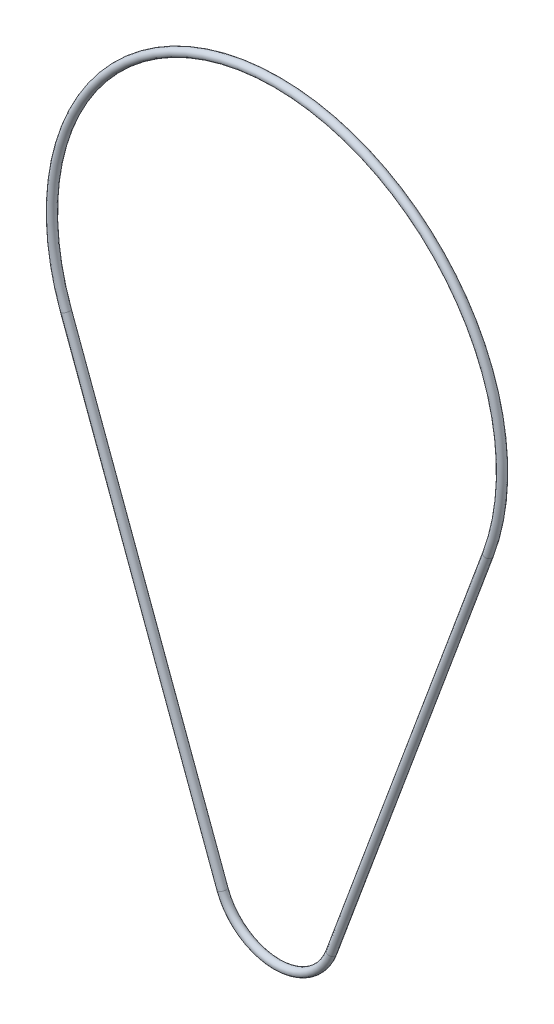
from build123d import *

# Parameters (mm, degrees)
SWEEP_1_PROFILE_R = 0.2


with BuildPart() as part:
    # Sweep 1: sweep along a path in Sketch 1
    with BuildLine(Plane.XY) as sweep_1_path:
        Line((-10.535701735, -3.901821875), (-2.719495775, -25.007145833))
        ThreePointArc((-2.719495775, -25.007145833), (0, -26.9), (2.719495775, -25.007145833))
        Line((2.719495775, -25.007145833), (10.535701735, -3.901821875))
        ThreePointArc((10.535701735, -3.901821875), (0, 11.235), (-10.535701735, -3.901821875))
    # Sweep 1 profile (on start of the path) → Sweep 1 (sweep)
    with BuildSketch(Plane(origin=(-10.535701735, -3.901821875, 0), x_dir=(-0.9377571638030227, -0.34729166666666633, 0), z_dir=(0.34729166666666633, -0.9377571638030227, 0))):
        Circle(SWEEP_1_PROFILE_R)
    sweep(path=sweep_1_path.line)


solid = part.part
